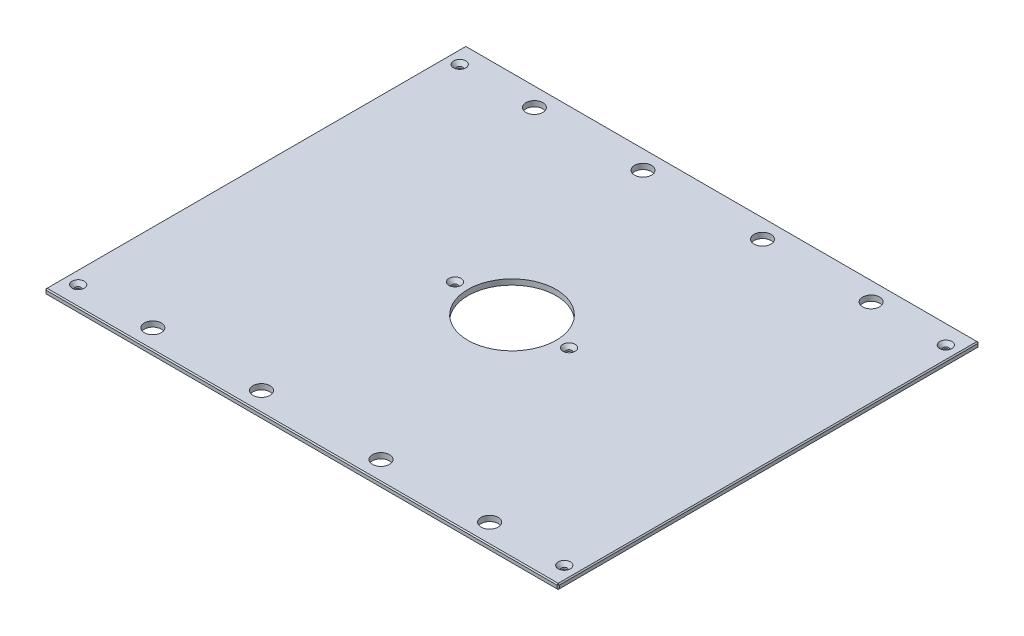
from build123d import *

# Parameters (mm, degrees)
SKETCH1_W                                     = 600.075
SKETCH1_H                                     = 492.125
BOSS_EXTRUDE1_DEPTH                           = 6.35
SKETCH13_R                                    = 51.562
CUT_EXTRUDE6_DEPTH                            = 389.084498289
F_25_32_0_78125_DIAMETER_HOLE1_D              = 19.84375
CHAMFER2_SIZE                                 = 1.27
CSK_FOR_1_4_FLAT_HEAD_MACHINE_SCREW1_AT_COUNT = 2
CSK_FOR_1_4_FLAT_HEAD_MACHINE_SCREW1_AT_PITCH = 446.08496
CSK_FOR_1_4_FLAT_HEAD_MACHINE_SCREW1_2_COUNT  = 2
CSK_FOR_1_4_FLAT_HEAD_MACHINE_SCREW1_2_PITCH  = 722.48536121
CSK_FOR_1_4_FLAT_HEAD_MACHINE_SCREW1_3_COUNT  = 2
CSK_FOR_1_4_FLAT_HEAD_MACHINE_SCREW1_3_PITCH  = 415.73416902
CSK_FOR_1_4_FLAT_HEAD_MACHINE_SCREW1_4_COUNT  = 2
CSK_FOR_1_4_FLAT_HEAD_MACHINE_SCREW1_4_PITCH  = 311.526500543
CSK_FOR_1_4_FLAT_HEAD_MACHINE_SCREW1_5_COUNT  = 2
CSK_FOR_1_4_FLAT_HEAD_MACHINE_SCREW1_5_PITCH  = 568.325
CSK_FOR_1_4_FLAT_HEAD_MACHINE_SCREW1_6_COUNT  = 2
CSK_FOR_1_4_FLAT_HEAD_MACHINE_SCREW1_6_PITCH  = 481.0125
CSK_FOR_1_4_FLAT_HEAD_MACHINE_SCREW1_7_COUNT  = 2
CSK_FOR_1_4_FLAT_HEAD_MACHINE_SCREW1_7_PITCH  = 656.021963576


with BuildPart() as part:
    # Sketch1 → Boss-Extrude1 (new body)
    with BuildSketch(Plane(origin=(0, 0, 0), x_dir=(1, 0, 0), z_dir=(0, 1, 0))):
        Rectangle(SKETCH1_W, SKETCH1_H)
    extrude(amount=BOSS_EXTRUDE1_DEPTH)

    # Sketch13 → Cut-Extrude6 (cut, through all)
    with BuildSketch(Plane(origin=(0, 6.35, 0), x_dir=(1, 0, 0), z_dir=(0, 1, 0))):
        with Locations(Location((0, 0, 0), (0, 0, 270))):
            Circle(SKETCH13_R)
    extrude(amount=-CUT_EXTRUDE6_DEPTH, mode=Mode.SUBTRACT)

    # 25_32 _0.78125_ Diameter Hole1 (through all)
    with Locations(Plane(origin=(0, 6.35, 0), x_dir=(1, 0, 0), z_dir=(0, 1, 0))):
        with Locations((196.85, 223.04248), (-196.85, 223.04248), (196.85, -223.04248), (-196.85, -223.04248), (-69.85, 223.04248), (69.85, 223.04248), (69.85, -223.04248), (-69.85, -223.04248)):
            Hole(F_25_32_0_78125_DIAMETER_HOLE1_D / 2)

    # Chamfer2
    chamfer2_edges = [part.edges().sort_by_distance(p)[0] for p in [
        (300.0375, 6.35, 0),
        (0, 6.35, -246.0625),
        (-300.0375, 6.35, 0),
        (0, 0, -246.0625),
        (300.0375, 0, 0),
        (0, 0, 246.0625),
        (-300.0375, 0, 0),
        (0, 6.35, 246.0625),
        (-300.0375, 3.175, -246.0625),
        (300.0375, 3.175, -246.0625),
        (300.0375, 3.175, 246.0625),
        (-300.0375, 3.175, 246.0625),
    ]]
    chamfer(chamfer2_edges, length=CHAMFER2_SIZE)

    # Sketch24 → CSK for 1_4 Flat Head Machine Screw1 (revolve, cut)
    with BuildSketch(Plane(origin=(284.1625, 6.35, -223.04248), x_dir=(0, 0, 1), z_dir=(1, 0, 0))):
        Polygon((0, 0), (0, 6.35), (3.3782, 6.35), (3.3782, 4.324464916), (7.1374, 0), align=None)
    csk_for_1_4_flat_head_machine_screw1 = revolve(axis=Axis((284.1625, 12.7, -223.04248), (0, -1, 0)), mode=Mode.SUBTRACT)

    # CSK for 1_4 Flat Head Machine Screw1 at: CSK for 1_4 Flat Head Machine Screw1 ×2
    with Locations(*[(0, 0, i * CSK_FOR_1_4_FLAT_HEAD_MACHINE_SCREW1_AT_PITCH) for i in range(1, CSK_FOR_1_4_FLAT_HEAD_MACHINE_SCREW1_AT_COUNT)]):
        add(csk_for_1_4_flat_head_machine_screw1, mode=Mode.SUBTRACT)

    # CSK for 1_4 Flat Head Machine Screw1 2: CSK for 1_4 Flat Head Machine Screw1 ×2
    with Locations(*[Vector(-0.7866249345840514, 0, 0.6174311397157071) * (i * CSK_FOR_1_4_FLAT_HEAD_MACHINE_SCREW1_2_PITCH) for i in range(1, CSK_FOR_1_4_FLAT_HEAD_MACHINE_SCREW1_2_COUNT)]):
        add(csk_for_1_4_flat_head_machine_screw1, mode=Mode.SUBTRACT)

    # CSK for 1_4 Flat Head Machine Screw1 3: CSK for 1_4 Flat Head Machine Screw1 ×2
    with Locations(*[Vector(-0.843898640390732, 0, 0.5365026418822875) * (i * CSK_FOR_1_4_FLAT_HEAD_MACHINE_SCREW1_3_PITCH) for i in range(1, CSK_FOR_1_4_FLAT_HEAD_MACHINE_SCREW1_3_COUNT)]):
        add(csk_for_1_4_flat_head_machine_screw1, mode=Mode.SUBTRACT)

    # CSK for 1_4 Flat Head Machine Screw1 4: CSK for 1_4 Flat Head Machine Screw1 ×2
    with Locations(*[Vector(-0.6981348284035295, 0, 0.7159663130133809) * (i * CSK_FOR_1_4_FLAT_HEAD_MACHINE_SCREW1_4_PITCH) for i in range(1, CSK_FOR_1_4_FLAT_HEAD_MACHINE_SCREW1_4_COUNT)]):
        add(csk_for_1_4_flat_head_machine_screw1, mode=Mode.SUBTRACT)

    # CSK for 1_4 Flat Head Machine Screw1 5: CSK for 1_4 Flat Head Machine Screw1 ×2
    with Locations(*[(-i * CSK_FOR_1_4_FLAT_HEAD_MACHINE_SCREW1_5_PITCH, 0, 0) for i in range(1, CSK_FOR_1_4_FLAT_HEAD_MACHINE_SCREW1_5_COUNT)]):
        add(csk_for_1_4_flat_head_machine_screw1, mode=Mode.SUBTRACT)

    # CSK for 1_4 Flat Head Machine Screw1 6: CSK for 1_4 Flat Head Machine Screw1 ×2
    with Locations(*[(-i * CSK_FOR_1_4_FLAT_HEAD_MACHINE_SCREW1_6_PITCH, 0, 0) for i in range(1, CSK_FOR_1_4_FLAT_HEAD_MACHINE_SCREW1_6_COUNT)]):
        add(csk_for_1_4_flat_head_machine_screw1, mode=Mode.SUBTRACT)

    # CSK for 1_4 Flat Head Machine Screw1 7: CSK for 1_4 Flat Head Machine Screw1 ×2
    with Locations(*[Vector(-0.7332262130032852, 0, 0.6799847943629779) * (i * CSK_FOR_1_4_FLAT_HEAD_MACHINE_SCREW1_7_PITCH) for i in range(1, CSK_FOR_1_4_FLAT_HEAD_MACHINE_SCREW1_7_COUNT)]):
        add(csk_for_1_4_flat_head_machine_screw1, mode=Mode.SUBTRACT)


solid = part.part
